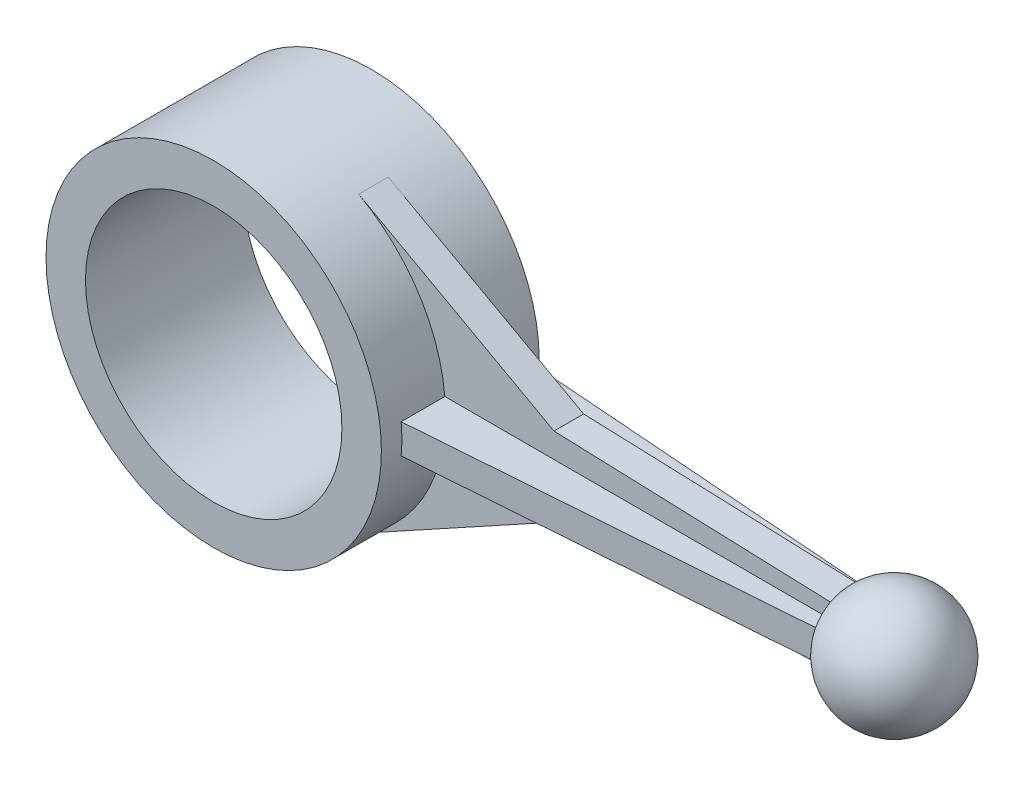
ISO-10303-21;
HEADER;
FILE_DESCRIPTION(('STEP AP214'),'2;1');
FILE_NAME('part.step','',(''),(''),'','','');
FILE_SCHEMA(('AUTOMOTIVE_DESIGN { 1 0 10303 214 1 1 1 1 }'));
ENDSEC;
DATA;
#1=APPLICATION_CONTEXT('core data for automotive mechanical design processes');
#2=APPLICATION_PROTOCOL_DEFINITION('international standard','automotive_design',2000,#1);
#3=PRODUCT_CONTEXT('',#1,'mechanical');
#4=PRODUCT('Part','Part','',(#3));
#5=PRODUCT_RELATED_PRODUCT_CATEGORY('part','',(#4));
#6=PRODUCT_DEFINITION_FORMATION('','',#4);
#7=PRODUCT_DEFINITION_CONTEXT('part definition',#1,'design');
#8=PRODUCT_DEFINITION('design','',#6,#7);
#9=PRODUCT_DEFINITION_SHAPE('','',#8);
#10=(LENGTH_UNIT() NAMED_UNIT(*) SI_UNIT(.MILLI.,.METRE.));
#11=(NAMED_UNIT(*) PLANE_ANGLE_UNIT() SI_UNIT($,.RADIAN.));
#12=(NAMED_UNIT(*) SI_UNIT($,.STERADIAN.) SOLID_ANGLE_UNIT());
#13=UNCERTAINTY_MEASURE_WITH_UNIT(LENGTH_MEASURE(1.E-05),#10,'distance_accuracy_value','');
#14=(GEOMETRIC_REPRESENTATION_CONTEXT(3) GLOBAL_UNCERTAINTY_ASSIGNED_CONTEXT((#13)) GLOBAL_UNIT_ASSIGNED_CONTEXT((#10,
#11,#12)) REPRESENTATION_CONTEXT('',''));
#15=CARTESIAN_POINT('',(0.,0.,0.));
#16=DIRECTION('',(0.,0.,1.));
#17=DIRECTION('',(1.,0.,0.));
#18=AXIS2_PLACEMENT_3D('',#15,#16,#17);
#19=CARTESIAN_POINT('',(28.,0.,0.75));
#20=DIRECTION('',(-1.,0.,0.));
#21=DIRECTION('',(0.,0.,1.));
#22=AXIS2_PLACEMENT_3D('',#19,#20,#21);
#23=PLANE('',#22);
#24=DIRECTION('',(0.,-1.,0.));
#25=VECTOR('',#24,1.);
#26=CARTESIAN_POINT('',(28.,0.75,1.5));
#27=LINE('',#26,#25);
#28=CARTESIAN_POINT('',(28.,0.75,1.5));
#29=VERTEX_POINT('',#28);
#30=CARTESIAN_POINT('',(28.,0.707106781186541,1.5));
#31=VERTEX_POINT('',#30);
#32=EDGE_CURVE('E285',#29,#31,#27,.T.);
#33=ORIENTED_EDGE('',*,*,#32,.T.);
#34=CARTESIAN_POINT('',(28.,0.,0.));
#35=DIRECTION('',(-1.,0.,0.));
#36=DIRECTION('',(0.,0.,1.));
#37=AXIS2_PLACEMENT_3D('',#34,#35,#36);
#38=CIRCLE('',#37,1.6583123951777);
#39=CARTESIAN_POINT('',(28.,0.75,1.4790199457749));
#40=VERTEX_POINT('',#39);
#41=EDGE_CURVE('E250',#31,#40,#38,.T.);
#42=ORIENTED_EDGE('',*,*,#41,.T.);
#43=DIRECTION('',(0.,0.,-1.));
#44=VECTOR('',#43,1.);
#45=CARTESIAN_POINT('',(28.,0.75,0.));
#46=LINE('',#45,#44);
#47=EDGE_CURVE('E282',#29,#40,#46,.T.);
#48=ORIENTED_EDGE('',*,*,#47,.F.);
#49=EDGE_LOOP('',(#33,#42,#48));
#50=FACE_BOUND('',#49,.T.);
#51=ADVANCED_FACE('F39',(#50),#23,.F.);
#52=DIRECTION('',(0.,1.,0.));
#53=VECTOR('',#52,1.);
#54=CARTESIAN_POINT('',(28.,0.,0.75));
#55=LINE('',#54,#53);
#56=CARTESIAN_POINT('',(28.,1.4790199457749,0.75));
#57=VERTEX_POINT('',#56);
#58=CARTESIAN_POINT('',(28.,1.5,0.75));
#59=VERTEX_POINT('',#58);
#60=EDGE_CURVE('E340',#57,#59,#55,.T.);
#61=ORIENTED_EDGE('',*,*,#60,.F.);
#62=CARTESIAN_POINT('',(28.,1.5,0.707106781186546));
#63=VERTEX_POINT('',#62);
#64=EDGE_CURVE('E226',#57,#63,#38,.T.);
#65=ORIENTED_EDGE('',*,*,#64,.T.);
#66=DIRECTION('',(0.,0.,-1.));
#67=VECTOR('',#66,1.);
#68=CARTESIAN_POINT('',(28.,1.5,0.75));
#69=LINE('',#68,#67);
#70=EDGE_CURVE('E357',#59,#63,#69,.T.);
#71=ORIENTED_EDGE('',*,*,#70,.F.);
#72=EDGE_LOOP('',(#61,#65,#71));
#73=FACE_BOUND('',#72,.T.);
#74=ADVANCED_FACE('F441',(#73),#23,.F.);
#75=CARTESIAN_POINT('',(28.,1.5,-0.707106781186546));
#76=VERTEX_POINT('',#75);
#77=CARTESIAN_POINT('',(28.,1.5,-0.75));
#78=VERTEX_POINT('',#77);
#79=EDGE_CURVE('E356',#76,#78,#69,.T.);
#80=ORIENTED_EDGE('',*,*,#79,.F.);
#81=CARTESIAN_POINT('',(28.,1.4790199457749,-0.75));
#82=VERTEX_POINT('',#81);
#83=EDGE_CURVE('E222',#76,#82,#38,.T.);
#84=ORIENTED_EDGE('',*,*,#83,.T.);
#85=DIRECTION('',(0.,1.,0.));
#86=VECTOR('',#85,1.);
#87=CARTESIAN_POINT('',(28.,0.,-0.75));
#88=LINE('',#87,#86);
#89=EDGE_CURVE('E330',#82,#78,#88,.T.);
#90=ORIENTED_EDGE('',*,*,#89,.T.);
#91=EDGE_LOOP('',(#80,#84,#90));
#92=FACE_BOUND('',#91,.T.);
#93=ADVANCED_FACE('F445',(#92),#23,.F.);
#94=DIRECTION('',(0.,0.,1.));
#95=VECTOR('',#94,1.);
#96=CARTESIAN_POINT('',(28.,0.75,0.));
#97=LINE('',#96,#95);
#98=CARTESIAN_POINT('',(28.,0.75,-1.5));
#99=VERTEX_POINT('',#98);
#100=CARTESIAN_POINT('',(28.,0.75,-1.4790199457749));
#101=VERTEX_POINT('',#100);
#102=EDGE_CURVE('E318',#99,#101,#97,.T.);
#103=ORIENTED_EDGE('',*,*,#102,.T.);
#104=CARTESIAN_POINT('',(28.,0.707106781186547,-1.5));
#105=VERTEX_POINT('',#104);
#106=EDGE_CURVE('E236',#101,#105,#38,.T.);
#107=ORIENTED_EDGE('',*,*,#106,.T.);
#108=DIRECTION('',(0.,1.,0.));
#109=VECTOR('',#108,1.);
#110=CARTESIAN_POINT('',(28.,-0.75,-1.5));
#111=LINE('',#110,#109);
#112=EDGE_CURVE('E324',#105,#99,#111,.T.);
#113=ORIENTED_EDGE('',*,*,#112,.T.);
#114=EDGE_LOOP('',(#103,#107,#113));
#115=FACE_BOUND('',#114,.T.);
#116=ADVANCED_FACE('F437',(#115),#23,.F.);
#117=CARTESIAN_POINT('',(28.,-0.75,-1.5));
#118=VERTEX_POINT('',#117);
#119=CARTESIAN_POINT('',(28.,-0.707106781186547,-1.5));
#120=VERTEX_POINT('',#119);
#121=EDGE_CURVE('E325',#118,#120,#111,.T.);
#122=ORIENTED_EDGE('',*,*,#121,.T.);
#123=CARTESIAN_POINT('',(28.,-0.75,-1.4790199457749));
#124=VERTEX_POINT('',#123);
#125=EDGE_CURVE('E243',#120,#124,#38,.T.);
#126=ORIENTED_EDGE('',*,*,#125,.T.);
#127=DIRECTION('',(0.,0.,1.));
#128=VECTOR('',#127,1.);
#129=CARTESIAN_POINT('',(28.,-0.75,0.));
#130=LINE('',#129,#128);
#131=EDGE_CURVE('E322',#118,#124,#130,.T.);
#132=ORIENTED_EDGE('',*,*,#131,.F.);
#133=EDGE_LOOP('',(#122,#126,#132));
#134=FACE_BOUND('',#133,.T.);
#135=ADVANCED_FACE('F431',(#134),#23,.F.);
#136=DIRECTION('',(0.,-1.,0.));
#137=VECTOR('',#136,1.);
#138=CARTESIAN_POINT('',(28.,0.,-0.75));
#139=LINE('',#138,#137);
#140=CARTESIAN_POINT('',(28.,-1.47901994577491,-0.74999999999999));
#141=VERTEX_POINT('',#140);
#142=CARTESIAN_POINT('',(28.,-1.50000000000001,-0.749999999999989));
#143=VERTEX_POINT('',#142);
#144=EDGE_CURVE('E296',#141,#143,#139,.T.);
#145=ORIENTED_EDGE('',*,*,#144,.F.);
#146=CARTESIAN_POINT('',(28.,-1.5,-0.707106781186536));
#147=VERTEX_POINT('',#146);
#148=EDGE_CURVE('E223',#141,#147,#38,.T.);
#149=ORIENTED_EDGE('',*,*,#148,.T.);
#150=DIRECTION('',(0.,0.,1.));
#151=VECTOR('',#150,1.);
#152=CARTESIAN_POINT('',(28.,-1.50000000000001,-0.749999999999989));
#153=LINE('',#152,#151);
#154=EDGE_CURVE('E313',#143,#147,#153,.T.);
#155=ORIENTED_EDGE('',*,*,#154,.F.);
#156=EDGE_LOOP('',(#145,#149,#155));
#157=FACE_BOUND('',#156,.T.);
#158=ADVANCED_FACE('F429',(#157),#23,.F.);
#159=CARTESIAN_POINT('',(28.,-1.49999999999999,0.707106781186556));
#160=VERTEX_POINT('',#159);
#161=CARTESIAN_POINT('',(28.,-1.49999999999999,0.750000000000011));
#162=VERTEX_POINT('',#161);
#163=EDGE_CURVE('E312',#160,#162,#153,.T.);
#164=ORIENTED_EDGE('',*,*,#163,.F.);
#165=CARTESIAN_POINT('',(28.,-1.4790199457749,0.75));
#166=VERTEX_POINT('',#165);
#167=EDGE_CURVE('E220',#160,#166,#38,.T.);
#168=ORIENTED_EDGE('',*,*,#167,.T.);
#169=EDGE_CURVE('E207',#162,#166,#55,.T.);
#170=ORIENTED_EDGE('',*,*,#169,.F.);
#171=EDGE_LOOP('',(#164,#168,#170));
#172=FACE_BOUND('',#171,.T.);
#173=ADVANCED_FACE('F420',(#172),#23,.F.);
#174=CARTESIAN_POINT('',(0.,0.,4.));
#175=DIRECTION('',(0.,0.,-1.));
#176=DIRECTION('',(-1.,0.,0.));
#177=AXIS2_PLACEMENT_3D('',#174,#175,#176);
#178=CYLINDRICAL_SURFACE('',#177,8.5);
#179=CARTESIAN_POINT('',(0.,0.,4.));
#180=DIRECTION('',(0.,0.,1.));
#181=DIRECTION('',(1.,0.,0.));
#182=AXIS2_PLACEMENT_3D('',#179,#180,#181);
#183=CIRCLE('',#182,8.5);
#184=CARTESIAN_POINT('',(8.5,0.,4.));
#185=VERTEX_POINT('',#184);
#186=EDGE_CURVE('E368',#185,#185,#183,.T.);
#187=ORIENTED_EDGE('',*,*,#186,.F.);
#188=EDGE_LOOP('',(#187));
#189=FACE_BOUND('',#188,.T.);
#190=CARTESIAN_POINT('',(0.,0.,-4.));
#191=DIRECTION('',(0.,0.,1.));
#192=DIRECTION('',(1.,0.,0.));
#193=AXIS2_PLACEMENT_3D('',#190,#191,#192);
#194=CIRCLE('',#193,8.5);
#195=CARTESIAN_POINT('',(8.5,0.,-4.));
#196=VERTEX_POINT('',#195);
#197=EDGE_CURVE('E365',#196,#196,#194,.T.);
#198=ORIENTED_EDGE('',*,*,#197,.T.);
#199=EDGE_LOOP('',(#198));
#200=FACE_BOUND('',#199,.T.);
#201=DIRECTION('',(0.,0.,-1.));
#202=VECTOR('',#201,1.);
#203=CARTESIAN_POINT('',(8.46684711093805,0.75,4.));
#204=LINE('',#203,#202);
#205=CARTESIAN_POINT('',(8.46684711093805,0.75,0.75));
#206=VERTEX_POINT('',#205);
#207=CARTESIAN_POINT('',(8.46684711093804,0.75,2.96498646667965));
#208=VERTEX_POINT('',#207);
#209=EDGE_CURVE('E288',#206,#208,#204,.F.);
#210=ORIENTED_EDGE('',*,*,#209,.F.);
#211=CARTESIAN_POINT('',(0.,0.,0.75));
#212=DIRECTION('',(0.,0.,-1.));
#213=DIRECTION('',(1.,0.,0.));
#214=AXIS2_PLACEMENT_3D('',#211,#212,#213);
#215=CIRCLE('',#214,8.5);
#216=CARTESIAN_POINT('',(4.09677436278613,7.4475794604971,0.75));
#217=VERTEX_POINT('',#216);
#218=EDGE_CURVE('E348',#217,#206,#215,.T.);
#219=ORIENTED_EDGE('',*,*,#218,.F.);
#220=DIRECTION('',(0.,0.,-1.));
#221=VECTOR('',#220,1.);
#222=CARTESIAN_POINT('',(4.09677436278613,7.4475794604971,0.75));
#223=LINE('',#222,#221);
#224=CARTESIAN_POINT('',(4.09677436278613,7.4475794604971,-0.75));
#225=VERTEX_POINT('',#224);
#226=EDGE_CURVE('E351',#217,#225,#223,.T.);
#227=ORIENTED_EDGE('',*,*,#226,.T.);
#228=CARTESIAN_POINT('',(0.,0.,-0.75));
#229=DIRECTION('',(0.,0.,-1.));
#230=DIRECTION('',(1.,0.,0.));
#231=AXIS2_PLACEMENT_3D('',#228,#229,#230);
#232=CIRCLE('',#231,8.5);
#233=CARTESIAN_POINT('',(8.46684711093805,0.75,-0.75));
#234=VERTEX_POINT('',#233);
#235=EDGE_CURVE('E337',#225,#234,#232,.T.);
#236=ORIENTED_EDGE('',*,*,#235,.T.);
#237=DIRECTION('',(0.,0.,-1.));
#238=VECTOR('',#237,1.);
#239=CARTESIAN_POINT('',(8.46684711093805,0.75,4.));
#240=LINE('',#239,#238);
#241=CARTESIAN_POINT('',(8.46684711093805,0.75,-2.96498646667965));
#242=VERTEX_POINT('',#241);
#243=EDGE_CURVE('E327',#234,#242,#240,.T.);
#244=ORIENTED_EDGE('',*,*,#243,.T.);
#245=CARTESIAN_POINT('',(0.,0.,-3.6));
#246=DIRECTION('',(-0.0747899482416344,0.,0.997199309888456));
#247=DIRECTION('',(-0.997199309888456,0.,-0.0747899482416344));
#248=AXIS2_PLACEMENT_3D('',#245,#246,#247);
#249=ELLIPSE('',#248,8.52387272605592,8.5);
#250=CARTESIAN_POINT('',(8.46684711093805,-0.75,-2.96498646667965));
#251=VERTEX_POINT('',#250);
#252=EDGE_CURVE('E373',#251,#242,#249,.T.);
#253=ORIENTED_EDGE('',*,*,#252,.F.);
#254=DIRECTION('',(0.,0.,-1.));
#255=VECTOR('',#254,1.);
#256=CARTESIAN_POINT('',(8.46684711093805,-0.75,4.));
#257=LINE('',#256,#255);
#258=CARTESIAN_POINT('',(8.46684711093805,-0.75,-0.749999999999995));
#259=VERTEX_POINT('',#258);
#260=EDGE_CURVE('E375',#259,#251,#257,.T.);
#261=ORIENTED_EDGE('',*,*,#260,.F.);
#262=CARTESIAN_POINT('',(0.,0.,-0.75));
#263=DIRECTION('',(0.,0.,1.));
#264=DIRECTION('',(1.,0.,0.));
#265=AXIS2_PLACEMENT_3D('',#262,#263,#264);
#266=CIRCLE('',#265,8.5);
#267=CARTESIAN_POINT('',(4.09677436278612,-7.44757946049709,-0.749999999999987));
#268=VERTEX_POINT('',#267);
#269=EDGE_CURVE('E303',#268,#259,#266,.T.);
#270=ORIENTED_EDGE('',*,*,#269,.F.);
#271=DIRECTION('',(0.,0.,1.));
#272=VECTOR('',#271,1.);
#273=CARTESIAN_POINT('',(4.09677436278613,-7.44757946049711,-0.749999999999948));
#274=LINE('',#273,#272);
#275=CARTESIAN_POINT('',(4.09677436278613,-7.4475794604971,0.750000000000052));
#276=VERTEX_POINT('',#275);
#277=EDGE_CURVE('E306',#268,#276,#274,.T.);
#278=ORIENTED_EDGE('',*,*,#277,.T.);
#279=CARTESIAN_POINT('',(8.46684711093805,-0.75,0.75));
#280=VERTEX_POINT('',#279);
#281=EDGE_CURVE('E347',#280,#276,#215,.T.);
#282=ORIENTED_EDGE('',*,*,#281,.F.);
#283=DIRECTION('',(0.,0.,-1.));
#284=VECTOR('',#283,1.);
#285=CARTESIAN_POINT('',(8.46684711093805,-0.75,4.));
#286=LINE('',#285,#284);
#287=CARTESIAN_POINT('',(8.46684711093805,-0.75,2.96498646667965));
#288=VERTEX_POINT('',#287);
#289=EDGE_CURVE('E195',#280,#288,#286,.F.);
#290=ORIENTED_EDGE('',*,*,#289,.T.);
#291=CARTESIAN_POINT('',(0.,0.,3.6));
#292=DIRECTION('',(-0.0747899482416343,0.,-0.997199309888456));
#293=DIRECTION('',(0.997199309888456,0.,-0.0747899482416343));
#294=AXIS2_PLACEMENT_3D('',#291,#292,#293);
#295=ELLIPSE('',#294,8.52387272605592,8.5);
#296=EDGE_CURVE('E47',#208,#288,#295,.T.);
#297=ORIENTED_EDGE('',*,*,#296,.F.);
#298=EDGE_LOOP('',(#210,#219,#227,#236,#244,#253,#261,#270,#278,#282,#290,#297));
#299=FACE_BOUND('',#298,.T.);
#300=ADVANCED_FACE('F41',(#189,#200,#299),#178,.T.);
#301=CARTESIAN_POINT('',(0.,0.,0.75));
#302=DIRECTION('',(0.,0.,1.));
#303=DIRECTION('',(1.,0.,0.));
#304=AXIS2_PLACEMENT_3D('',#301,#302,#303);
#305=PLANE('',#304);
#306=CARTESIAN_POINT('',(30.5,0.,0.75));
#307=DIRECTION('',(0.,0.,1.));
#308=DIRECTION('',(1.,0.,0.));
#309=AXIS2_PLACEMENT_3D('',#306,#307,#308);
#310=CIRCLE('',#309,2.90473750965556);
#311=CARTESIAN_POINT('',(27.6937569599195,0.75,0.75));
#312=VERTEX_POINT('',#311);
#313=EDGE_CURVE('E54',#57,#312,#310,.T.);
#314=ORIENTED_EDGE('',*,*,#313,.F.);
#315=ORIENTED_EDGE('',*,*,#60,.T.);
#316=DIRECTION('',(-0.99936285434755,0.0356915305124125,0.));
#317=VECTOR('',#316,1.);
#318=CARTESIAN_POINT('',(28.,1.5,0.75));
#319=LINE('',#318,#317);
#320=CARTESIAN_POINT('',(14.,2.,0.75));
#321=VERTEX_POINT('',#320);
#322=EDGE_CURVE('E342',#59,#321,#319,.T.);
#323=ORIENTED_EDGE('',*,*,#322,.T.);
#324=DIRECTION('',(-0.876185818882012,0.481973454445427,0.));
#325=VECTOR('',#324,1.);
#326=CARTESIAN_POINT('',(14.,2.,0.75));
#327=LINE('',#326,#325);
#328=EDGE_CURVE('E344',#321,#217,#327,.T.);
#329=ORIENTED_EDGE('',*,*,#328,.T.);
#330=ORIENTED_EDGE('',*,*,#218,.T.);
#331=DIRECTION('',(1.,0.,0.));
#332=VECTOR('',#331,1.);
#333=CARTESIAN_POINT('',(0.,0.75,0.75));
#334=LINE('',#333,#332);
#335=EDGE_CURVE('E198',#206,#312,#334,.T.);
#336=ORIENTED_EDGE('',*,*,#335,.T.);
#337=EDGE_LOOP('',(#314,#315,#323,#329,#330,#336));
#338=FACE_BOUND('',#337,.T.);
#339=ADVANCED_FACE('F389',(#338),#305,.T.);
#340=CARTESIAN_POINT('',(0.,0.,4.));
#341=DIRECTION('',(0.,0.,1.));
#342=DIRECTION('',(1.,0.,0.));
#343=AXIS2_PLACEMENT_3D('',#340,#341,#342);
#344=PLANE('',#343);
#345=ORIENTED_EDGE('',*,*,#186,.T.);
#346=EDGE_LOOP('',(#345));
#347=FACE_BOUND('',#346,.T.);
#348=CARTESIAN_POINT('',(0.,0.,4.));
#349=DIRECTION('',(0.,0.,1.));
#350=DIRECTION('',(1.,0.,0.));
#351=AXIS2_PLACEMENT_3D('',#348,#349,#350);
#352=CIRCLE('',#351,6.5);
#353=CARTESIAN_POINT('',(6.5,0.,4.));
#354=VERTEX_POINT('',#353);
#355=EDGE_CURVE('E362',#354,#354,#352,.T.);
#356=ORIENTED_EDGE('',*,*,#355,.F.);
#357=EDGE_LOOP('',(#356));
#358=FACE_BOUND('',#357,.T.);
#359=ADVANCED_FACE('F458',(#347,#358),#344,.T.);
#360=CARTESIAN_POINT('',(0.,0.,-4.));
#361=DIRECTION('',(0.,0.,1.));
#362=DIRECTION('',(1.,0.,0.));
#363=AXIS2_PLACEMENT_3D('',#360,#361,#362);
#364=PLANE('',#363);
#365=ORIENTED_EDGE('',*,*,#197,.F.);
#366=EDGE_LOOP('',(#365));
#367=FACE_BOUND('',#366,.T.);
#368=CARTESIAN_POINT('',(0.,0.,-4.));
#369=DIRECTION('',(0.,0.,1.));
#370=DIRECTION('',(1.,0.,0.));
#371=AXIS2_PLACEMENT_3D('',#368,#369,#370);
#372=CIRCLE('',#371,6.5);
#373=CARTESIAN_POINT('',(6.5,0.,-4.));
#374=VERTEX_POINT('',#373);
#375=EDGE_CURVE('E359',#374,#374,#372,.T.);
#376=ORIENTED_EDGE('',*,*,#375,.T.);
#377=EDGE_LOOP('',(#376));
#378=FACE_BOUND('',#377,.T.);
#379=ADVANCED_FACE('F453',(#367,#378),#364,.F.);
#380=CARTESIAN_POINT('',(0.,0.,4.));
#381=DIRECTION('',(0.,0.,-1.));
#382=DIRECTION('',(-1.,0.,0.));
#383=AXIS2_PLACEMENT_3D('',#380,#381,#382);
#384=CYLINDRICAL_SURFACE('',#383,6.5);
#385=ORIENTED_EDGE('',*,*,#355,.T.);
#386=EDGE_LOOP('',(#385));
#387=FACE_BOUND('',#386,.T.);
#388=ORIENTED_EDGE('',*,*,#375,.F.);
#389=EDGE_LOOP('',(#388));
#390=FACE_BOUND('',#389,.T.);
#391=ADVANCED_FACE('F448',(#387,#390),#384,.F.);
#392=DIRECTION('',(0.,0.,-1.));
#393=VECTOR('',#392,1.);
#394=CARTESIAN_POINT('',(28.,-0.75,0.));
#395=LINE('',#394,#393);
#396=CARTESIAN_POINT('',(28.,-0.75,1.5));
#397=VERTEX_POINT('',#396);
#398=CARTESIAN_POINT('',(28.,-0.75,1.4790199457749));
#399=VERTEX_POINT('',#398);
#400=EDGE_CURVE('E231',#397,#399,#395,.T.);
#401=ORIENTED_EDGE('',*,*,#400,.T.);
#402=CARTESIAN_POINT('',(28.,-0.707106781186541,1.5));
#403=VERTEX_POINT('',#402);
#404=EDGE_CURVE('E210',#399,#403,#38,.T.);
#405=ORIENTED_EDGE('',*,*,#404,.T.);
#406=EDGE_CURVE('E284',#403,#397,#27,.T.);
#407=ORIENTED_EDGE('',*,*,#406,.T.);
#408=EDGE_LOOP('',(#401,#405,#407));
#409=FACE_BOUND('',#408,.T.);
#410=ADVANCED_FACE('F384',(#409),#23,.F.);
#411=CARTESIAN_POINT('',(28.,1.5,0.75));
#412=DIRECTION('',(-0.0356915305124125,-0.999362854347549,0.));
#413=DIRECTION('',(0.99936285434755,-0.0356915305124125,0.));
#414=AXIS2_PLACEMENT_3D('',#411,#412,#413);
#415=PLANE('',#414);
#416=ORIENTED_EDGE('',*,*,#70,.T.);
#417=CARTESIAN_POINT('',(30.5503184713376,1.40891719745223,0.));
#418=DIRECTION('',(-0.0356915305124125,-0.999362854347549,0.));
#419=DIRECTION('',(0.99936285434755,-0.0356915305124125,0.));
#420=AXIS2_PLACEMENT_3D('',#417,#418,#419);
#421=CIRCLE('',#420,2.64809750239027);
#422=EDGE_CURVE('E62',#63,#76,#421,.T.);
#423=ORIENTED_EDGE('',*,*,#422,.T.);
#424=ORIENTED_EDGE('',*,*,#79,.T.);
#425=DIRECTION('',(-0.99936285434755,0.0356915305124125,0.));
#426=VECTOR('',#425,1.);
#427=CARTESIAN_POINT('',(28.,1.5,-0.75));
#428=LINE('',#427,#426);
#429=CARTESIAN_POINT('',(14.,2.,-0.75));
#430=VERTEX_POINT('',#429);
#431=EDGE_CURVE('E332',#78,#430,#428,.T.);
#432=ORIENTED_EDGE('',*,*,#431,.T.);
#433=DIRECTION('',(0.,0.,-1.));
#434=VECTOR('',#433,1.);
#435=CARTESIAN_POINT('',(14.,2.,0.75));
#436=LINE('',#435,#434);
#437=EDGE_CURVE('E353',#321,#430,#436,.T.);
#438=ORIENTED_EDGE('',*,*,#437,.F.);
#439=ORIENTED_EDGE('',*,*,#322,.F.);
#440=EDGE_LOOP('',(#416,#423,#424,#432,#438,#439));
#441=FACE_BOUND('',#440,.T.);
#442=ADVANCED_FACE('F447',(#441),#415,.F.);
#443=CARTESIAN_POINT('',(14.,2.,0.75));
#444=DIRECTION('',(-0.481973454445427,-0.876185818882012,0.));
#445=DIRECTION('',(0.876185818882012,-0.481973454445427,0.));
#446=AXIS2_PLACEMENT_3D('',#443,#444,#445);
#447=PLANE('',#446);
#448=DIRECTION('',(-0.876185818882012,0.481973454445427,0.));
#449=VECTOR('',#448,1.);
#450=CARTESIAN_POINT('',(14.,2.,-0.75));
#451=LINE('',#450,#449);
#452=EDGE_CURVE('E334',#430,#225,#451,.T.);
#453=ORIENTED_EDGE('',*,*,#452,.T.);
#454=ORIENTED_EDGE('',*,*,#226,.F.);
#455=ORIENTED_EDGE('',*,*,#328,.F.);
#456=ORIENTED_EDGE('',*,*,#437,.T.);
#457=EDGE_LOOP('',(#453,#454,#455,#456));
#458=FACE_BOUND('',#457,.T.);
#459=ADVANCED_FACE('F395',(#458),#447,.F.);
#460=CARTESIAN_POINT('',(30.5,0.,0.75));
#461=DIRECTION('',(0.,0.,1.));
#462=DIRECTION('',(1.,0.,0.));
#463=AXIS2_PLACEMENT_3D('',#460,#461,#462);
#464=CIRCLE('',#463,2.90473750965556);
#465=CARTESIAN_POINT('',(27.6937569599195,-0.75,0.75));
#466=VERTEX_POINT('',#465);
#467=EDGE_CURVE('E203',#466,#166,#464,.T.);
#468=ORIENTED_EDGE('',*,*,#467,.F.);
#469=DIRECTION('',(1.,0.,0.));
#470=VECTOR('',#469,1.);
#471=CARTESIAN_POINT('',(0.,-0.75,0.75));
#472=LINE('',#471,#470);
#473=EDGE_CURVE('E189',#280,#466,#472,.T.);
#474=ORIENTED_EDGE('',*,*,#473,.F.);
#475=ORIENTED_EDGE('',*,*,#281,.T.);
#476=DIRECTION('',(-0.876185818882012,-0.481973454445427,0.));
#477=VECTOR('',#476,1.);
#478=CARTESIAN_POINT('',(14.,-1.99999999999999,0.750000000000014));
#479=LINE('',#478,#477);
#480=CARTESIAN_POINT('',(14.,-1.99999999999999,0.750000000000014));
#481=VERTEX_POINT('',#480);
#482=EDGE_CURVE('E293',#481,#276,#479,.T.);
#483=ORIENTED_EDGE('',*,*,#482,.F.);
#484=DIRECTION('',(-0.99936285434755,-0.0356915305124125,0.));
#485=VECTOR('',#484,1.);
#486=CARTESIAN_POINT('',(28.,-1.49999999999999,0.750000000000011));
#487=LINE('',#486,#485);
#488=EDGE_CURVE('E291',#162,#481,#487,.T.);
#489=ORIENTED_EDGE('',*,*,#488,.F.);
#490=ORIENTED_EDGE('',*,*,#169,.T.);
#491=EDGE_LOOP('',(#468,#474,#475,#483,#489,#490));
#492=FACE_BOUND('',#491,.T.);
#493=ADVANCED_FACE('F204',(#492),#305,.T.);
#494=CARTESIAN_POINT('',(0.,0.,-0.75));
#495=DIRECTION('',(0.,0.,1.));
#496=DIRECTION('',(1.,0.,0.));
#497=AXIS2_PLACEMENT_3D('',#494,#495,#496);
#498=PLANE('',#497);
#499=ORIENTED_EDGE('',*,*,#89,.F.);
#500=CARTESIAN_POINT('',(30.5,0.,-0.75));
#501=DIRECTION('',(0.,0.,1.));
#502=DIRECTION('',(1.,0.,0.));
#503=AXIS2_PLACEMENT_3D('',#500,#501,#502);
#504=CIRCLE('',#503,2.90473750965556);
#505=CARTESIAN_POINT('',(27.6937569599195,0.75,-0.75));
#506=VERTEX_POINT('',#505);
#507=EDGE_CURVE('E233',#82,#506,#504,.T.);
#508=ORIENTED_EDGE('',*,*,#507,.T.);
#509=DIRECTION('',(-1.,0.,0.));
#510=VECTOR('',#509,1.);
#511=CARTESIAN_POINT('',(0.,0.75,-0.75));
#512=LINE('',#511,#510);
#513=EDGE_CURVE('E371',#506,#234,#512,.T.);
#514=ORIENTED_EDGE('',*,*,#513,.T.);
#515=ORIENTED_EDGE('',*,*,#235,.F.);
#516=ORIENTED_EDGE('',*,*,#452,.F.);
#517=ORIENTED_EDGE('',*,*,#431,.F.);
#518=EDGE_LOOP('',(#499,#508,#514,#515,#516,#517));
#519=FACE_BOUND('',#518,.T.);
#520=ADVANCED_FACE('F399',(#519),#498,.F.);
#521=CARTESIAN_POINT('',(28.,-0.75,-1.5));
#522=DIRECTION('',(-0.0747899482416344,0.,0.997199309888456));
#523=DIRECTION('',(0.997199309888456,0.,0.0747899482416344));
#524=AXIS2_PLACEMENT_3D('',#521,#522,#523);
#525=PLANE('',#524);
#526=ORIENTED_EDGE('',*,*,#112,.F.);
#527=CARTESIAN_POINT('',(30.5978868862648,0.,-1.30515848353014));
#528=DIRECTION('',(-0.0747899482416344,0.,0.997199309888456));
#529=DIRECTION('',(0.997199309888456,0.,0.0747899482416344));
#530=AXIS2_PLACEMENT_3D('',#527,#528,#529);
#531=CIRCLE('',#530,2.6994405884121);
#532=EDGE_CURVE('E242',#105,#120,#531,.T.);
#533=ORIENTED_EDGE('',*,*,#532,.T.);
#534=ORIENTED_EDGE('',*,*,#121,.F.);
#535=DIRECTION('',(0.997199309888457,0.,0.0747899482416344));
#536=VECTOR('',#535,1.);
#537=CARTESIAN_POINT('',(28.,-0.75,-1.5));
#538=LINE('',#537,#536);
#539=EDGE_CURVE('E320',#251,#118,#538,.T.);
#540=ORIENTED_EDGE('',*,*,#539,.F.);
#541=ORIENTED_EDGE('',*,*,#252,.T.);
#542=DIRECTION('',(0.997199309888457,0.,0.0747899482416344));
#543=VECTOR('',#542,1.);
#544=CARTESIAN_POINT('',(28.,0.75,-1.5));
#545=LINE('',#544,#543);
#546=EDGE_CURVE('E315',#242,#99,#545,.T.);
#547=ORIENTED_EDGE('',*,*,#546,.T.);
#548=EDGE_LOOP('',(#526,#533,#534,#540,#541,#547));
#549=FACE_BOUND('',#548,.T.);
#550=ADVANCED_FACE('F411',(#549),#525,.F.);
#551=CARTESIAN_POINT('',(28.,-0.75,0.));
#552=DIRECTION('',(0.,1.,0.));
#553=DIRECTION('',(0.,0.,1.));
#554=AXIS2_PLACEMENT_3D('',#551,#552,#553);
#555=PLANE('',#554);
#556=ORIENTED_EDGE('',*,*,#131,.T.);
#557=CARTESIAN_POINT('',(30.5,-0.75,0.));
#558=DIRECTION('',(0.,1.,0.));
#559=DIRECTION('',(0.,0.,1.));
#560=AXIS2_PLACEMENT_3D('',#557,#558,#559);
#561=CIRCLE('',#560,2.90473750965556);
#562=CARTESIAN_POINT('',(27.6937569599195,-0.75,-0.749999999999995));
#563=VERTEX_POINT('',#562);
#564=EDGE_CURVE('E249',#124,#563,#561,.T.);
#565=ORIENTED_EDGE('',*,*,#564,.T.);
#566=DIRECTION('',(-1.,0.,0.));
#567=VECTOR('',#566,1.);
#568=CARTESIAN_POINT('',(28.,-0.75,-0.749999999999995));
#569=LINE('',#568,#567);
#570=EDGE_CURVE('E199',#563,#259,#569,.T.);
#571=ORIENTED_EDGE('',*,*,#570,.T.);
#572=ORIENTED_EDGE('',*,*,#260,.T.);
#573=ORIENTED_EDGE('',*,*,#539,.T.);
#574=EDGE_LOOP('',(#556,#565,#571,#572,#573));
#575=FACE_BOUND('',#574,.T.);
#576=ADVANCED_FACE('F414',(#575),#555,.F.);
#577=CARTESIAN_POINT('',(28.,0.75,0.));
#578=DIRECTION('',(0.,1.,0.));
#579=DIRECTION('',(0.,0.,1.));
#580=AXIS2_PLACEMENT_3D('',#577,#578,#579);
#581=PLANE('',#580);
#582=CARTESIAN_POINT('',(30.5,0.75,0.));
#583=DIRECTION('',(0.,1.,0.));
#584=DIRECTION('',(0.,0.,1.));
#585=AXIS2_PLACEMENT_3D('',#582,#583,#584);
#586=CIRCLE('',#585,2.90473750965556);
#587=EDGE_CURVE('E235',#101,#506,#586,.T.);
#588=ORIENTED_EDGE('',*,*,#587,.F.);
#589=ORIENTED_EDGE('',*,*,#102,.F.);
#590=ORIENTED_EDGE('',*,*,#546,.F.);
#591=ORIENTED_EDGE('',*,*,#243,.F.);
#592=ORIENTED_EDGE('',*,*,#513,.F.);
#593=EDGE_LOOP('',(#588,#589,#590,#591,#592));
#594=FACE_BOUND('',#593,.T.);
#595=ADVANCED_FACE('F405',(#594),#581,.T.);
#596=CARTESIAN_POINT('',(0.,0.,-0.75));
#597=DIRECTION('',(0.,0.,-1.));
#598=DIRECTION('',(1.,0.,0.));
#599=AXIS2_PLACEMENT_3D('',#596,#597,#598);
#600=PLANE('',#599);
#601=CARTESIAN_POINT('',(30.5,0.,-0.75));
#602=DIRECTION('',(0.,0.,-1.));
#603=DIRECTION('',(0.,1.,0.));
#604=AXIS2_PLACEMENT_3D('',#601,#602,#603);
#605=CIRCLE('',#604,2.90473750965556);
#606=EDGE_CURVE('E257',#141,#563,#605,.T.);
#607=ORIENTED_EDGE('',*,*,#606,.F.);
#608=ORIENTED_EDGE('',*,*,#144,.T.);
#609=DIRECTION('',(-0.99936285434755,-0.0356915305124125,0.));
#610=VECTOR('',#609,1.);
#611=CARTESIAN_POINT('',(28.,-1.50000000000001,-0.749999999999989));
#612=LINE('',#611,#610);
#613=CARTESIAN_POINT('',(14.,-2.00000000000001,-0.749999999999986));
#614=VERTEX_POINT('',#613);
#615=EDGE_CURVE('E298',#143,#614,#612,.T.);
#616=ORIENTED_EDGE('',*,*,#615,.T.);
#617=DIRECTION('',(-0.876185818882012,-0.481973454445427,0.));
#618=VECTOR('',#617,1.);
#619=CARTESIAN_POINT('',(14.,-2.00000000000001,-0.749999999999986));
#620=LINE('',#619,#618);
#621=EDGE_CURVE('E300',#614,#268,#620,.T.);
#622=ORIENTED_EDGE('',*,*,#621,.T.);
#623=ORIENTED_EDGE('',*,*,#269,.T.);
#624=ORIENTED_EDGE('',*,*,#570,.F.);
#625=EDGE_LOOP('',(#607,#608,#616,#622,#623,#624));
#626=FACE_BOUND('',#625,.T.);
#627=ADVANCED_FACE('F418',(#626),#600,.T.);
#628=CARTESIAN_POINT('',(28.,-1.50000000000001,-0.749999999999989));
#629=DIRECTION('',(-0.0356915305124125,0.999362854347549,0.));
#630=DIRECTION('',(-0.99936285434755,-0.0356915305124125,0.));
#631=AXIS2_PLACEMENT_3D('',#628,#629,#630);
#632=PLANE('',#631);
#633=ORIENTED_EDGE('',*,*,#154,.T.);
#634=CARTESIAN_POINT('',(30.5503184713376,-1.40891719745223,0.));
#635=DIRECTION('',(-0.0356915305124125,0.999362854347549,0.));
#636=DIRECTION('',(-0.99936285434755,-0.0356915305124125,0.));
#637=AXIS2_PLACEMENT_3D('',#634,#635,#636);
#638=CIRCLE('',#637,2.64809750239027);
#639=EDGE_CURVE('E265',#147,#160,#638,.T.);
#640=ORIENTED_EDGE('',*,*,#639,.T.);
#641=ORIENTED_EDGE('',*,*,#163,.T.);
#642=ORIENTED_EDGE('',*,*,#488,.T.);
#643=DIRECTION('',(0.,0.,1.));
#644=VECTOR('',#643,1.);
#645=CARTESIAN_POINT('',(14.,-2.00000000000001,-0.749999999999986));
#646=LINE('',#645,#644);
#647=EDGE_CURVE('E309',#614,#481,#646,.T.);
#648=ORIENTED_EDGE('',*,*,#647,.F.);
#649=ORIENTED_EDGE('',*,*,#615,.F.);
#650=EDGE_LOOP('',(#633,#640,#641,#642,#648,#649));
#651=FACE_BOUND('',#650,.T.);
#652=ADVANCED_FACE('F421',(#651),#632,.F.);
#653=CARTESIAN_POINT('',(14.,-2.00000000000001,-0.749999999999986));
#654=DIRECTION('',(-0.481973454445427,0.876185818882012,0.));
#655=DIRECTION('',(-0.876185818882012,-0.481973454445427,0.));
#656=AXIS2_PLACEMENT_3D('',#653,#654,#655);
#657=PLANE('',#656);
#658=ORIENTED_EDGE('',*,*,#482,.T.);
#659=ORIENTED_EDGE('',*,*,#277,.F.);
#660=ORIENTED_EDGE('',*,*,#621,.F.);
#661=ORIENTED_EDGE('',*,*,#647,.T.);
#662=EDGE_LOOP('',(#658,#659,#660,#661));
#663=FACE_BOUND('',#662,.T.);
#664=ADVANCED_FACE('F427',(#663),#657,.F.);
#665=CARTESIAN_POINT('',(28.,0.75,1.5));
#666=DIRECTION('',(-0.0747899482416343,0.,-0.997199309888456));
#667=DIRECTION('',(-0.997199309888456,0.,0.0747899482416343));
#668=AXIS2_PLACEMENT_3D('',#665,#666,#667);
#669=PLANE('',#668);
#670=ORIENTED_EDGE('',*,*,#406,.F.);
#671=CARTESIAN_POINT('',(30.5978868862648,0.,1.30515848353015));
#672=DIRECTION('',(-0.0747899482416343,0.,-0.997199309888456));
#673=DIRECTION('',(-0.997199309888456,0.,0.0747899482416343));
#674=AXIS2_PLACEMENT_3D('',#671,#672,#673);
#675=CIRCLE('',#674,2.6994405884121);
#676=EDGE_CURVE('E217',#403,#31,#675,.T.);
#677=ORIENTED_EDGE('',*,*,#676,.T.);
#678=ORIENTED_EDGE('',*,*,#32,.F.);
#679=DIRECTION('',(0.997199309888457,0.,-0.0747899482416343));
#680=VECTOR('',#679,1.);
#681=CARTESIAN_POINT('',(28.,0.75,1.5));
#682=LINE('',#681,#680);
#683=EDGE_CURVE('E280',#208,#29,#682,.T.);
#684=ORIENTED_EDGE('',*,*,#683,.F.);
#685=ORIENTED_EDGE('',*,*,#296,.T.);
#686=DIRECTION('',(0.997199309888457,0.,-0.0747899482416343));
#687=VECTOR('',#686,1.);
#688=CARTESIAN_POINT('',(28.,-0.75,1.5));
#689=LINE('',#688,#687);
#690=EDGE_CURVE('E225',#288,#397,#689,.T.);
#691=ORIENTED_EDGE('',*,*,#690,.T.);
#692=EDGE_LOOP('',(#670,#677,#678,#684,#685,#691));
#693=FACE_BOUND('',#692,.T.);
#694=ADVANCED_FACE('F381',(#693),#669,.F.);
#695=CARTESIAN_POINT('',(28.,0.75,0.));
#696=DIRECTION('',(0.,-1.,0.));
#697=DIRECTION('',(0.,0.,-1.));
#698=AXIS2_PLACEMENT_3D('',#695,#696,#697);
#699=PLANE('',#698);
#700=ORIENTED_EDGE('',*,*,#47,.T.);
#701=CARTESIAN_POINT('',(30.5,0.75,0.));
#702=DIRECTION('',(0.,-1.,0.));
#703=DIRECTION('',(0.,0.,-1.));
#704=AXIS2_PLACEMENT_3D('',#701,#702,#703);
#705=CIRCLE('',#704,2.90473750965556);
#706=EDGE_CURVE('E259',#40,#312,#705,.T.);
#707=ORIENTED_EDGE('',*,*,#706,.T.);
#708=ORIENTED_EDGE('',*,*,#335,.F.);
#709=ORIENTED_EDGE('',*,*,#209,.T.);
#710=ORIENTED_EDGE('',*,*,#683,.T.);
#711=EDGE_LOOP('',(#700,#707,#708,#709,#710));
#712=FACE_BOUND('',#711,.T.);
#713=ADVANCED_FACE('F388',(#712),#699,.F.);
#714=CARTESIAN_POINT('',(28.,-0.75,0.));
#715=DIRECTION('',(0.,-1.,0.));
#716=DIRECTION('',(0.,0.,-1.));
#717=AXIS2_PLACEMENT_3D('',#714,#715,#716);
#718=PLANE('',#717);
#719=CARTESIAN_POINT('',(30.5,-0.75,0.));
#720=DIRECTION('',(0.,-1.,0.));
#721=DIRECTION('',(0.,0.,-1.));
#722=AXIS2_PLACEMENT_3D('',#719,#720,#721);
#723=CIRCLE('',#722,2.90473750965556);
#724=EDGE_CURVE('E11',#399,#466,#723,.T.);
#725=ORIENTED_EDGE('',*,*,#724,.F.);
#726=ORIENTED_EDGE('',*,*,#400,.F.);
#727=ORIENTED_EDGE('',*,*,#690,.F.);
#728=ORIENTED_EDGE('',*,*,#289,.F.);
#729=ORIENTED_EDGE('',*,*,#473,.T.);
#730=EDGE_LOOP('',(#725,#726,#727,#728,#729));
#731=FACE_BOUND('',#730,.T.);
#732=ADVANCED_FACE('F191',(#731),#718,.T.);
#733=CARTESIAN_POINT('',(30.5,0.,0.));
#734=DIRECTION('',(1.,0.,0.));
#735=DIRECTION('',(0.,0.,1.));
#736=AXIS2_PLACEMENT_3D('',#733,#734,#735);
#737=SPHERICAL_SURFACE('',#736,3.);
#738=ORIENTED_EDGE('',*,*,#83,.F.);
#739=ORIENTED_EDGE('',*,*,#422,.F.);
#740=ORIENTED_EDGE('',*,*,#64,.F.);
#741=ORIENTED_EDGE('',*,*,#313,.T.);
#742=ORIENTED_EDGE('',*,*,#706,.F.);
#743=ORIENTED_EDGE('',*,*,#41,.F.);
#744=ORIENTED_EDGE('',*,*,#676,.F.);
#745=ORIENTED_EDGE('',*,*,#404,.F.);
#746=ORIENTED_EDGE('',*,*,#724,.T.);
#747=ORIENTED_EDGE('',*,*,#467,.T.);
#748=ORIENTED_EDGE('',*,*,#167,.F.);
#749=ORIENTED_EDGE('',*,*,#639,.F.);
#750=ORIENTED_EDGE('',*,*,#148,.F.);
#751=ORIENTED_EDGE('',*,*,#606,.T.);
#752=ORIENTED_EDGE('',*,*,#564,.F.);
#753=ORIENTED_EDGE('',*,*,#125,.F.);
#754=ORIENTED_EDGE('',*,*,#532,.F.);
#755=ORIENTED_EDGE('',*,*,#106,.F.);
#756=ORIENTED_EDGE('',*,*,#587,.T.);
#757=ORIENTED_EDGE('',*,*,#507,.F.);
#758=EDGE_LOOP('',(#738,#739,#740,#741,#742,#743,#744,#745,#746,#747,#748,#749,#750,#751,#752,
#753,#754,#755,#756,#757));
#759=FACE_BOUND('',#758,.T.);
#760=ADVANCED_FACE('F214',(#759),#737,.T.);
#761=CLOSED_SHELL('',(#51,#74,#93,#116,#135,#158,#173,#300,#339,#359,#379,#391,#410,#442,#459,
#493,#520,#550,#576,#595,#627,#652,#664,#694,#713,#732,#760));
#762=MANIFOLD_SOLID_BREP('B2',#761);
#763=ADVANCED_BREP_SHAPE_REPRESENTATION('',(#18,#762),#14);
#764=SHAPE_DEFINITION_REPRESENTATION(#9,#763);
ENDSEC;
END-ISO-10303-21;
